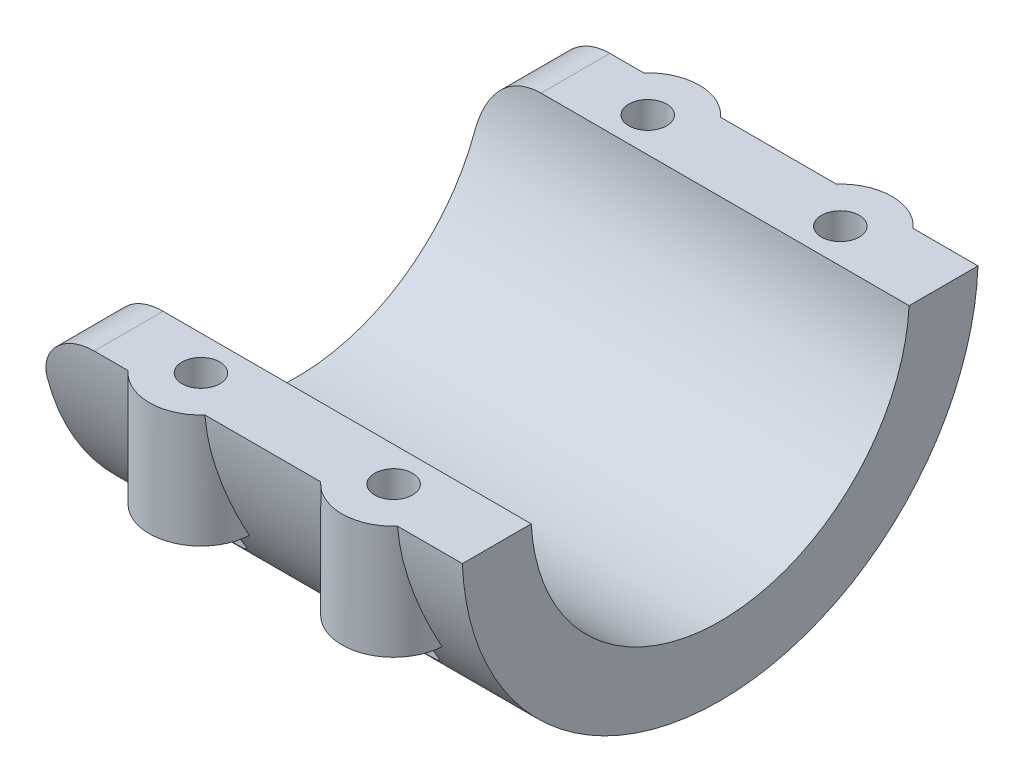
from build123d import *

# Parameters (mm, degrees)
ENL_V_MAT_EXTRU_1_DEPTH           = 114.192314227
ENL_V_MAT_EXTRU_1_DEPTH_BACK      = 114.192314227
EXTRUSION1_DEPTH                  = 16.5
ESQUISSE4_R                       = 4.5
ENL_V_MAT_EXTRU_2_DEPTH           = 6
ENL_V_MAT_EXTRU_2_OTHER_WAY_DEPTH = 122.150374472
ENL_V_MAT_EXTRU_2_OTHER_WAY_TAPER = -2
ESQUISSE5_R                       = 2.75
ENL_V_MAT_EXTRU_3_DEPTH           = 115.534550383
ENL_V_MAT_EXTRU_5_DEPTH           = 115.032509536
ENL_V_MAT_EXTRU_5_DEPTH_BACK      = 115.032509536


with BuildPart() as part:
    # Esquisse1 → R_volution1 (revolve)
    with BuildSketch(Plane.XY):
        with BuildLine():
            Line((0, 16.5), (0, 2.5))
            Line((0, 2.5), (36, 2.5))
            Line((36, 2.5), (36, 27.5))
            Line((36, 27.5), (100, 27.5))
            Line((100, 27.5), (100, 37.5))
            Line((100, 37.5), (26, 37.5))
            Line((26, 37.5), (26, 31.970814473))
            ThreePointArc((26, 31.970814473), (23.656854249, 26.313960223), (18, 23.970814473))
            Line((18, 23.970814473), (18, 17.5))
            Line((18, 17.5), (4, 17.5))
            Line((4, 17.5), (4, 16))
            Line((4, 16), (2, 16))
            Line((2, 16), (2, 17.5))
            Line((2, 17.5), (1, 17.5))
            Line((1, 17.5), (0, 16.5))
        make_face()
    revolve(axis=Axis((0, 0, 0), (1, 0, 0)))

    # Esquisse2 → Enl_v. mat.-Extru.1 (cut, two sides: drawn at the far end of the back side and taken through both)
    with BuildSketch(Plane.XY.offset(-ENL_V_MAT_EXTRU_1_DEPTH_BACK)):
        with BuildLine():
            Line((36, 40.868359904), (36, 8.5))
            ThreePointArc((36, 8.5), (38.928932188, 1.428932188), (46, -1.5))
            Line((46, -1.5), (100, -1.5))
            Line((100, -1.5), (100, 40.868359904))
            Line((100, 40.868359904), (36, 40.868359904))
        make_face()
    extrude(amount=ENL_V_MAT_EXTRU_1_DEPTH + ENL_V_MAT_EXTRU_1_DEPTH_BACK, mode=Mode.SUBTRACT)

    # Esquisse3 → Extrusion1 (add)
    with BuildSketch(Plane(origin=(0, -1.5, 0), x_dir=(-1, 0, 0), z_dir=(0, 1, 0))):
        with BuildLine():
            Line((-91.700381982, 29.094823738), (-78.299618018, 29.094823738))
            ThreePointArc((-78.299618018, 29.094823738), (-85, 39.964524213), (-91.700381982, 29.094823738))
        make_face()
        with BuildLine():
            Line((-63.700381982, 29.094823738), (-50.299618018, 29.094823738))
            ThreePointArc((-50.299618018, 29.094823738), (-57, 39.964524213), (-63.700381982, 29.094823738))
        make_face()
        with BuildLine():
            Line((-63.700381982, -29.094823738), (-50.299618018, -29.094823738))
            ThreePointArc((-50.299618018, -29.094823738), (-57, -39.964524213), (-63.700381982, -29.094823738))
        make_face()
        with BuildLine():
            Line((-91.700381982, -29.094823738), (-78.299618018, -29.094823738))
            ThreePointArc((-78.299618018, -29.094823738), (-85, -39.964524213), (-91.700381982, -29.094823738))
        make_face()
    extrude(amount=-EXTRUSION1_DEPTH)

    # Esquisse4 → Enl_v. mat.-Extru.2 (cut)
    with BuildSketch(Plane.XZ.offset(18)):
        with Locations(Location((85, 32.464524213, 0), (0, 0, 270))):
            Circle(ESQUISSE4_R)
        with Locations(Location((57, -32.464524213, 0), (0, 0, 354.477765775))):
            Circle(ESQUISSE4_R)
        with Locations(Location((85, -32.464524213, 0), (0, 0, 354.477765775))):
            Circle(ESQUISSE4_R)
        with Locations(Location((57, 32.464524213, 0), (0, 0, 270))):
            Circle(ESQUISSE4_R)
    extrude(amount=-ENL_V_MAT_EXTRU_2_DEPTH, mode=Mode.SUBTRACT)

    # Esquisse4 → Enl_v. mat.-Extru.2 other way (cut)
    with BuildSketch(Plane.XZ.offset(18)):
        with Locations(Location((85, 32.464524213, 0), (0, 0, 270))):
            Circle(ESQUISSE4_R)
        with Locations(Location((57, -32.464524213, 0), (0, 0, 354.477765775))):
            Circle(ESQUISSE4_R)
        with Locations(Location((85, -32.464524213, 0), (0, 0, 354.477765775))):
            Circle(ESQUISSE4_R)
        with Locations(Location((57, 32.464524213, 0), (0, 0, 270))):
            Circle(ESQUISSE4_R)
    extrude(amount=ENL_V_MAT_EXTRU_2_OTHER_WAY_DEPTH, taper=ENL_V_MAT_EXTRU_2_OTHER_WAY_TAPER, mode=Mode.SUBTRACT)

    # Esquisse5 → Enl_v. mat.-Extru.3 (cut, through all)
    with BuildSketch(Plane(origin=(0, -1.5, 0), x_dir=(-1, 0, 0), z_dir=(0, 1, 0))):
        with Locations(Location((-85, -32.464524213, 0), (0, 0, 90))):
            Circle(ESQUISSE5_R)
        with Locations(Location((-57, -32.464524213, 0), (0, 0, 90))):
            Circle(ESQUISSE5_R)
        with Locations(Location((-57, 32.464524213, 0), (0, 0, 270))):
            Circle(ESQUISSE5_R)
        with Locations(Location((-85, 32.464524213, 0), (0, 0, 270))):
            Circle(ESQUISSE5_R)
    extrude(amount=-ENL_V_MAT_EXTRU_3_DEPTH, mode=Mode.SUBTRACT)

    # Esquisse7 → Enl_v. mat.-Extru.5 (cut, two sides: drawn at the far end of the back side and taken through both)
    with BuildSketch(Plane.XY.offset(-ENL_V_MAT_EXTRU_5_DEPTH_BACK)):
        with BuildLine():
            Line((38.5, -42.994917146), (38.5, -9.5))
            ThreePointArc((38.5, -9.5), (40.843145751, -3.843145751), (46.5, -1.5))
            Line((46.5, -1.5), (103.513948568, -1.5))
            Line((103.513948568, -1.5), (103.513948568, 48.957146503))
            Line((103.513948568, 48.957146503), (-8.460074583, 48.957146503))
            Line((-8.460074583, 48.957146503), (-8.460074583, -42.994917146))
            Line((-8.460074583, -42.994917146), (38.5, -42.994917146))
        make_face()
    extrude(amount=ENL_V_MAT_EXTRU_5_DEPTH + ENL_V_MAT_EXTRU_5_DEPTH_BACK, mode=Mode.SUBTRACT)


solid = part.part
